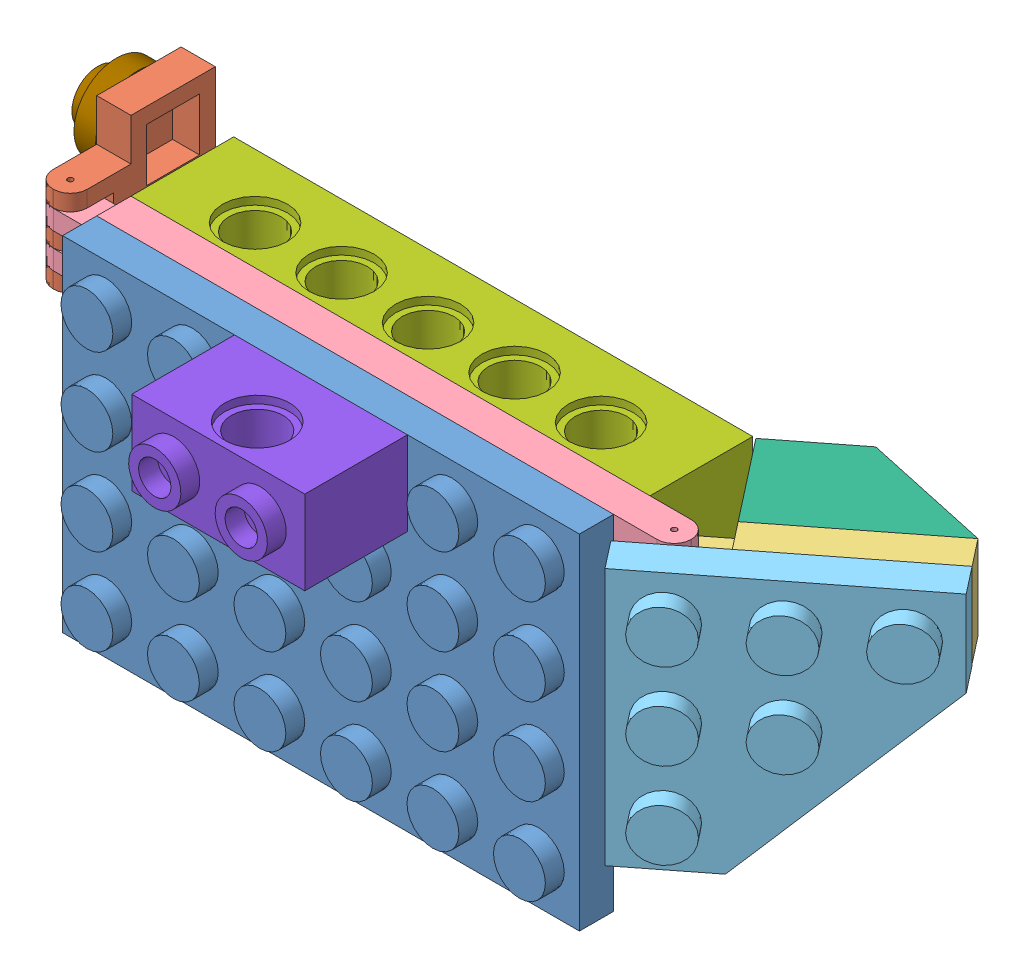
SolidWorks assembly Fender Rechts.SLDASM, configuration Default (file format 4400). Lengths in mm.
Overall size (80.75 37.4 36.93).
10 component instances, 9 part files, 25 mates.
Components (placement in the parent):
- Part0L64Rood-1: Part0L64Rood.SLDPRT [기본 설정] at origin size (47.8 31.8 4.91)
- Part0L2Rood scharnier-1: Part0L2Rood scharnier.SLDPRT [Default] at (-11.0476 -3.9317 -16.596) x (0 0 1) z (0 -1 0) size (13.4 4.87 15.8)
- Part0L2RoodB-1: Part0L2RoodB.SLDPRT [Default] at (45.4375 7.7383 -8.466) x (0 -1 0) z (-0.788011 0 0.615661) size (7.8 4.87 21.4)
- Part0L6BlauwB-1: Part0L6BlauwB.SLDPRT [Default] at (39.2224 7.8683 -6.326) x (-1 0 0) z (0 1 0) size (59 4.87 7.8)
- 3x3 corner-1: 3x3 corner.sldprt [Default] at (50.4599 -4.1617 -8.3723) x (0 -1 0) z (-0.788011 0 0.615661) size (23.8 4.87 23.8)
- Op zijn KOP 2HRood-1: Op zijn KOP 2HRood.SLDPRT [Default] at (45.814 3.8383 -20.8158) x (0.788011 0 -0.615661) z (0 -1 0) size (15.8 11.2 7.8)
- BASIS TECHNIEK 6 HRood-1: BASIS TECHNIEK 6 HRood.SLDPRT [Default] at (-8.5776 3.9933 -11.076) x (0 1 0) z (1 0 0) size (7.75 11.25 48)
- BASIS TECHNIEK 2 HRood-1: BASIS TECHNIEK 2 HRood.SLDPRT [Default] at (7.3224 3.9933 4.75) x (0 1 0) z (1 0 0) size (7.75 11.25 16)
- Remlicht Rood-1: Remlicht Rood.SLDPRT [Default] at (-14.2136 0.0683 -12.596) x (0 0.375857 -0.926678) z (0 0.926678 0.375857) size (7.8 3.7 7.8)
- Remlicht Rood-2: Remlicht Rood.SLDPRT [Default] at (-14.2136 8.0683 -12.596) x (0 -0.836551 -0.54789) z (0 0.54789 -0.836551) size (7.8 3.7 7.8)
Mates (geometry in assembly coordinates):
- Coincident4: coincident aligned: plane of Part0L64Rood-1 through (-8.5776 7.8683 -3.16) normal (0 1 0); plane of Part0L6BlauwB-1 through (39.2224 7.8683 -3.16) normal (0 1 0)
- Coincident5: coincident aligned: plane of Part0L64Rood-1 through (-8.5776 7.8683 -3.16) normal (-1 0 0); plane of Part0L6BlauwB-1 through (-8.5776 7.8683 -3.16) normal (-1 0 0)
- Coincident6: coincident anti-aligned: plane of Part0L64Rood-1 through (-8.5776 -23.9317 -3.16) normal (0 0 -1); plane of Part0L6BlauwB-1 through (39.2224 0.0683 -3.16) normal (0 0 1)
- Concentric1: concentric anti-aligned: cylinder of Part0L2Rood scharnier-1 through (-12.5976 11.8683 -4.746) axis (0 -1 0) radius 0.25; cylinder of Part0L6BlauwB-1 through (-12.5976 0.0683 -4.746) axis (0 1 0) radius 0.25
- Coincident7: coincident anti-aligned: plane of Part0L2Rood scharnier-1 through (-11.0476 3.2683 -3.196) normal (0 -1 0); plane of Part0L6BlauwB-1 through (-10.1776 3.2683 -3.16) normal (0 1 0)
- Concentric2: concentric anti-aligned: cylinder of Part0L2RoodB-1 through (43.2424 -0.0617 -4.746) axis (0 1 0) radius 0.25; cylinder of Part0L6BlauwB-1 through (43.2424 7.8683 -4.746) axis (0 -1 0) radius 0.25
- Coincident8: coincident anti-aligned: plane of Part0L2RoodB-1 through (46.1258 4.5683 -4.9861) normal (0 -1 0); plane of Part0L6BlauwB-1 through (44.8224 4.5683 -6.326) normal (0 1 0)
- Coincident9: coincident aligned: plane of Part0L2RoodB-1 through (59.8372 7.7383 -15.6986) normal (0.788011 0 -0.615661); plane of 3x3 corner-1 through (61.7864 7.7383 -13.2038) normal (0.788011 0 -0.615661)
- Coincident10: coincident aligned: plane of Part0L2RoodB-1 through (47.3866 7.7383 -5.9712) normal (0 1 0); plane of 3x3 corner-1 through (61.7864 7.7383 -13.2038) normal (0 1 0)
- Coincident11: coincident anti-aligned: plane of Part0L2RoodB-1 through (59.8372 7.7383 -15.6986) normal (0.615661 0 0.788011); plane of 3x3 corner-1 through (41.0826 7.7383 -1.0459) normal (-0.615661 0 -0.788011)
- Coincident12: coincident aligned: plane of Part0L2RoodB-1 through (47.3866 7.7383 -5.9712) normal (0 1 0); plane of Op zijn KOP 2HRood-1 through (57.888 7.7383 -18.1935) normal (0 1 0)
- Coincident13: coincident anti-aligned: plane of Part0L2RoodB-1 through (57.888 7.7383 -18.1935) normal (-0.615661 0 -0.788011); plane of Op zijn KOP 2HRood-1 through (45.4375 7.7383 -8.466) normal (0.615661 0 0.788011)
- Coincident14: coincident aligned: plane of Part0L2RoodB-1 through (47.3866 7.7383 -5.9712) normal (-0.788011 0 0.615661); plane of Op zijn KOP 2HRood-1 through (45.4375 -0.0617 -8.466) normal (-0.788011 0 0.615661)
- Coincident15: coincident aligned: plane of Part0L6BlauwB-1 through (39.2224 7.8683 -3.16) normal (0 1 0); plane of BASIS TECHNIEK 6 HRood-1 through (39.4224 7.8683 -15.826) normal (0 1 0)
- Coincident16: coincident aligned: plane of Part0L6BlauwB-1 through (-8.5776 7.8683 -3.16) normal (-1 0 0); plane of BASIS TECHNIEK 6 HRood-1 through (-8.5776 0.1183 -6.326) normal (-1 0 0)
- Coincident17: coincident anti-aligned: plane of Part0L6BlauwB-1 through (39.2224 0.0683 -6.326) normal (0 0 -1); plane of BASIS TECHNIEK 6 HRood-1 through (39.4224 7.8683 -6.326) normal (0 0 1)
- Width1: width: plane of Part0L64Rood-1 through (39.2224 7.8683 -3.16) normal (1 0 0); plane of Part0L64Rood-1 through (-8.5776 7.8683 -3.16) normal (-1 0 0); plane of BASIS TECHNIEK 2 HRood-1 through (7.3224 0.1183 9.5) normal (-1 0 0); plane of BASIS TECHNIEK 2 HRood-1 through (23.3224 0.1183 9.5) normal (1 0 0)
- Coincident18: coincident aligned: plane of Part0L64Rood-1 through (-8.5776 7.8683 -3.16) normal (0 1 0); plane of BASIS TECHNIEK 2 HRood-1 through (23.3224 7.8683 0) normal (0 1 0)
- Coincident19: coincident anti-aligned: plane of Part0L64Rood-1 through (-8.5776 -23.9317 0) normal (0 0 1); plane of BASIS TECHNIEK 2 HRood-1 through (23.3224 7.8683 0) normal (0 0 -1)
- Parallel1: parallel anti-aligned: plane of Part0L2Rood scharnier-1 through (-11.0476 11.8683 -16.596) normal (1 0 0); plane of BASIS TECHNIEK 6 HRood-1 through (-8.5776 0.1183 -6.326) normal (-1 0 0)
- Concentric3: concentric aligned: cylinder of Part0L2Rood scharnier-1 through (-15.9136 8.0683 -12.596) axis (1 0 0) radius 2.4; cylinder of Remlicht Rood-2 through (-15.9136 8.0683 -12.596) axis (1 0 0) radius 2.4
- Concentric4: concentric aligned: cylinder of Part0L2Rood scharnier-1 through (-15.9136 0.0683 -12.596) axis (1 0 0) radius 2.4; cylinder of Remlicht Rood-1 through (-15.9136 0.0683 -12.596) axis (1 0 0) radius 2.4
- Coincident21: coincident anti-aligned: plane of Part0L2Rood scharnier-1 through (-14.2136 11.8683 -16.596) normal (-1 0 0); plane of Remlicht Rood-2 through (-14.2136 8.0683 -12.596) normal (1 0 0)
- Coincident22: coincident anti-aligned: plane of Part0L2Rood scharnier-1 through (-14.2136 11.8683 -16.596) normal (-1 0 0); plane of Remlicht Rood-1 through (-14.2136 0.0683 -12.596) normal (1 0 0)
- Angle1: planar angle = 0.663225 rad aligned: plane of 3x3 corner-1 through (41.0826 7.7383 -1.0459) normal (-0.615661 0 -0.788011); plane of Part0L64Rood-1 through (-8.5776 -23.9317 -3.16) normal (0 0 -1)
